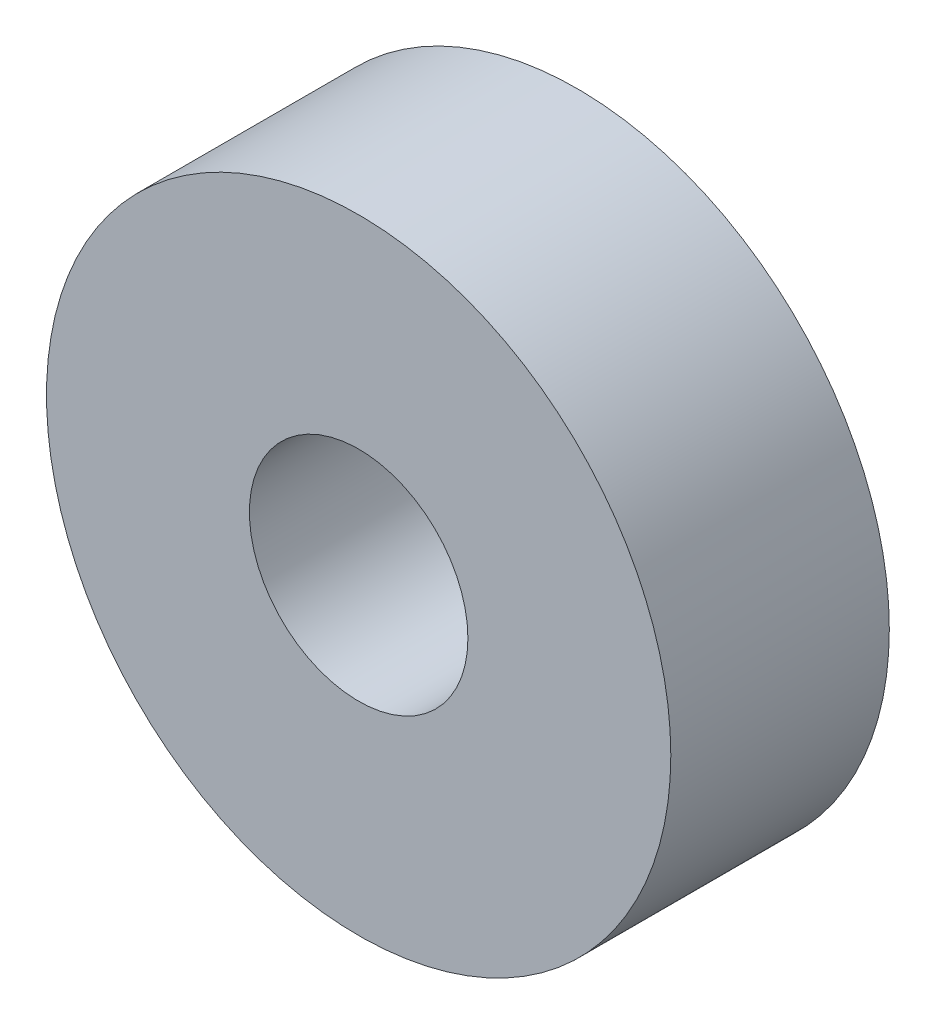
from build123d import *

# Parameters (mm, degrees)
SKETCH_1_R      = 10
SKETCH_1_R_2    = 3.5
EXTRUDE_1_DEPTH = 7


with BuildPart() as part:
    # Sketch 1 → Extrude 1 (new body)
    with BuildSketch(Plane.XY):
        Circle(SKETCH_1_R)
        Circle(SKETCH_1_R_2, mode=Mode.SUBTRACT)
    extrude(amount=EXTRUDE_1_DEPTH)


solid = part.part
